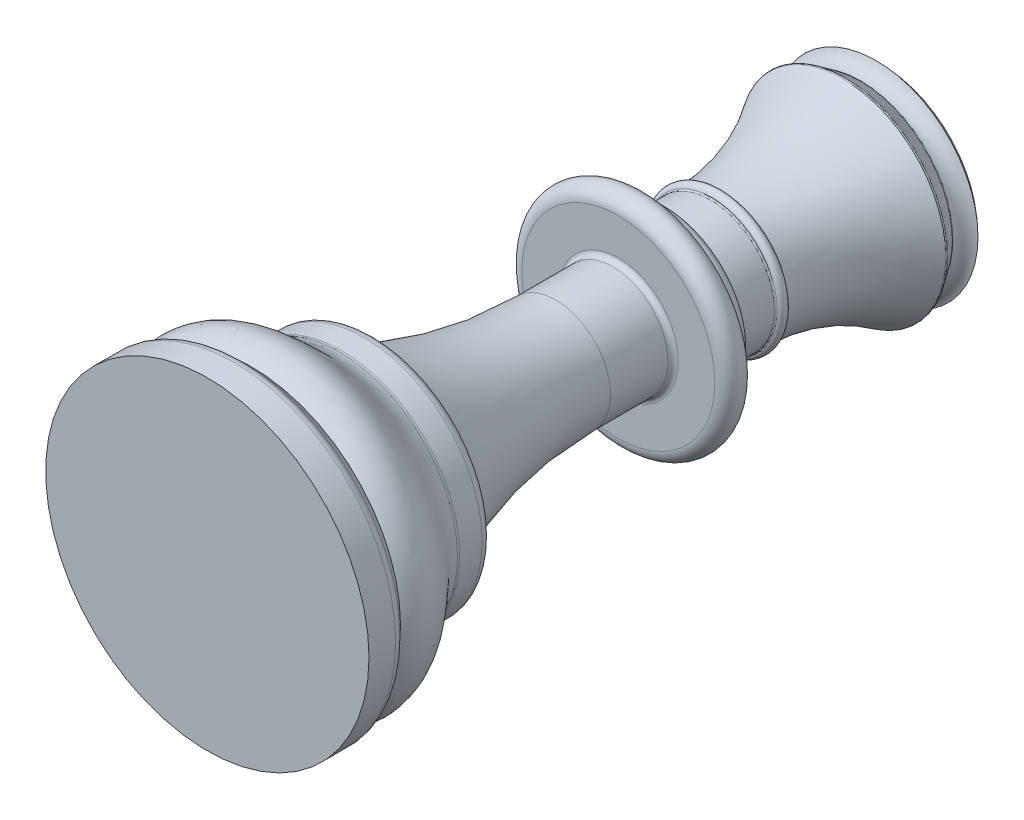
from build123d import *

# Parameters (mm, degrees)
FILLET1_R = 1
FILLET3_R = 0.15
FILLET4_R = 0.5


with BuildPart() as part:
    # Sketch1 → Revolve1 (revolve)
    with BuildSketch(Plane(origin=(0, 0, 0), x_dir=(1, 0, 0), z_dir=(0, 1, 0))):
        with BuildLine():
            Line((0, 0), (0, 66))
            ThreePointArc((0, 66), (1.944543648, 65.194543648), (2.75, 63.25))
            Line((2.75, 63.25), (8.802463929, 62.627797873))
            Line((8.802463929, 62.627797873), (9.940963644, 61))
            ThreePointArc((9.940963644, 61), (7.177029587, 55.457598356), (6.15, 49.35))
            ThreePointArc((6.15, 49.35), (6.65, 48.85), (6.15, 48.35))
            Line((6.15, 48.35), (6.15, 44.1))
            Line((6.15, 44.1), (8.1, 44.1))
            Line((8.1, 44.1), (8.1, 42.6))
            Line((8.1, 42.6), (9.652022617, 41.936275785))
            ThreePointArc((9.652022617, 41.936275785), (10.533970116, 40.496479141), (9.25, 39.4))
            Line((9.25, 39.4), (5.25, 39.4))
            Line((5.25, 39.4), (5.25, 33.4))
            ThreePointArc((5.25, 33.4), (6.197594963, 24.74496327), (8.99548304, 16.5))
            Line((8.99548304, 16.5), (11.327863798, 15.75))
            Line((11.327863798, 15.75), (11.327863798, 12.75))
            add(Edge.make_bspline(
                [(11.327863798, 12.75), (11.902666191, 10.107769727), (14.262589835, 9.730181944), (16.181994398, 6.898273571), (14.294055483, 4.223693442)],
                knots=[0, 0, 0, 0, 0, 1, 1, 1, 1, 1], degree=4))
            Line((14.294055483, 4.223693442), (15.5, 2.955430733))
            Line((15.5, 2.955430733), (15.5, 0))
            Line((15.5, 0), (0, 0))
        make_face()
    revolve(axis=Axis((0, 0, 0), (0, 0, -1)))

    # Fillet1
    fillet1_edges = [part.edges().sort_by_distance(p)[0] for p in [
        (-15.5, 0, -2.955430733),
        (-11.327863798, 0, -12.75),
        (-11.327863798, 0, -15.75),
        (-8.1, 0, -44.1),
    ]]
    fillet(fillet1_edges, radius=FILLET1_R)

    # Sketch6 → Revolve2 (revolve)
    with BuildSketch(Plane(origin=(0, 0, 0), x_dir=(1, 0, 0), z_dir=(0, 1, 0))):
        with BuildLine():
            Line((9.759016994, 64.127797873), (9.2, 64.627797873))
            ThreePointArc((9.2, 64.627797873), (7.634821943, 64.075630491), (6.5, 62.864494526))
            Line((6.5, 62.864494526), (8.802463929, 62.627797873))
            ThreePointArc((8.802463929, 62.627797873), (9.03436182, 63.534914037), (9.759016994, 64.127797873))
        make_face()
    revolve(axis=Axis((0, 0, -62.627797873), (0, 0, -1)))

    # Fillet3
    fillet3_edges = [part.edges().sort_by_distance(p)[0] for p in [
        (-8.99548304, 0, -16.5),
        (-6.15, 0, -44.1),
        (-6.15, 0, -48.35),
        (-6.15, 0, -49.35),
        (-9.940963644, 0, -61),
        (-2.75, 0, -63.25),
        (-6.5, 0, -62.864494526),
        (-8.802463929, 0, -62.627797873),
    ]]
    fillet(fillet3_edges, radius=FILLET3_R)

    # Fillet4
    fillet4_edges = [part.edges().sort_by_distance(p)[0] for p in [
        (-5.25, 0, -39.4),
    ]]
    fillet(fillet4_edges, radius=FILLET4_R)


solid = part.part
